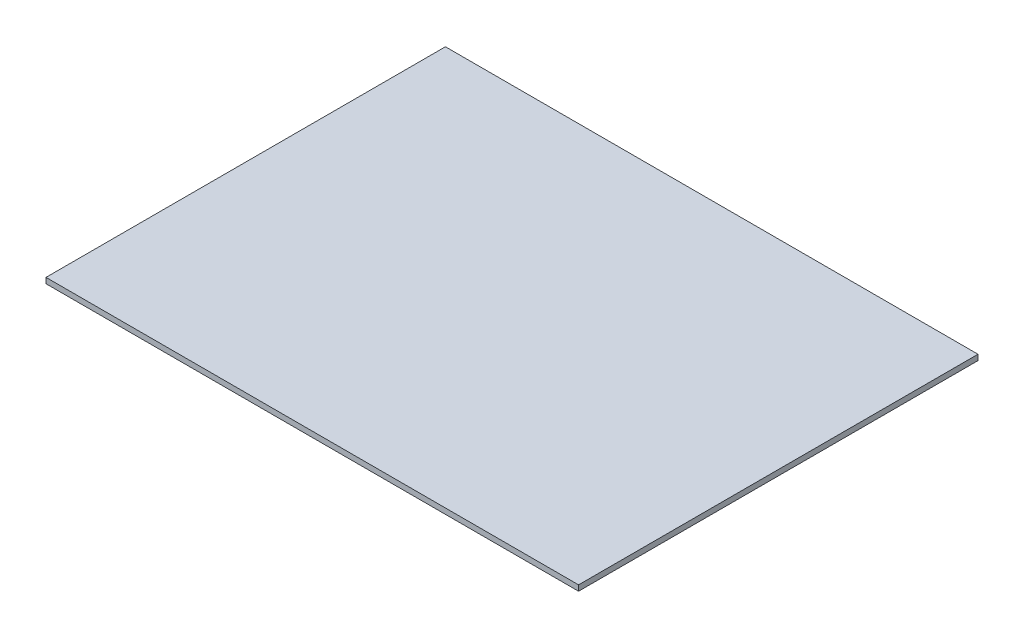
from build123d import *

# Parameters (mm, degrees)
SKETCH1_W           = 609.6
SKETCH1_H           = 457.2
BOSS_EXTRUDE1_DEPTH = 6.35


with BuildPart() as part:
    # Sketch1 → Boss-Extrude1 (new body)
    with BuildSketch(Plane(origin=(0, 0, 0), x_dir=(1, 0, 0), z_dir=(0, 1, 0))):
        with Locations((18.161658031, -304.8)):
            Rectangle(SKETCH1_W, SKETCH1_H)
    extrude(amount=BOSS_EXTRUDE1_DEPTH)


solid = part.part
